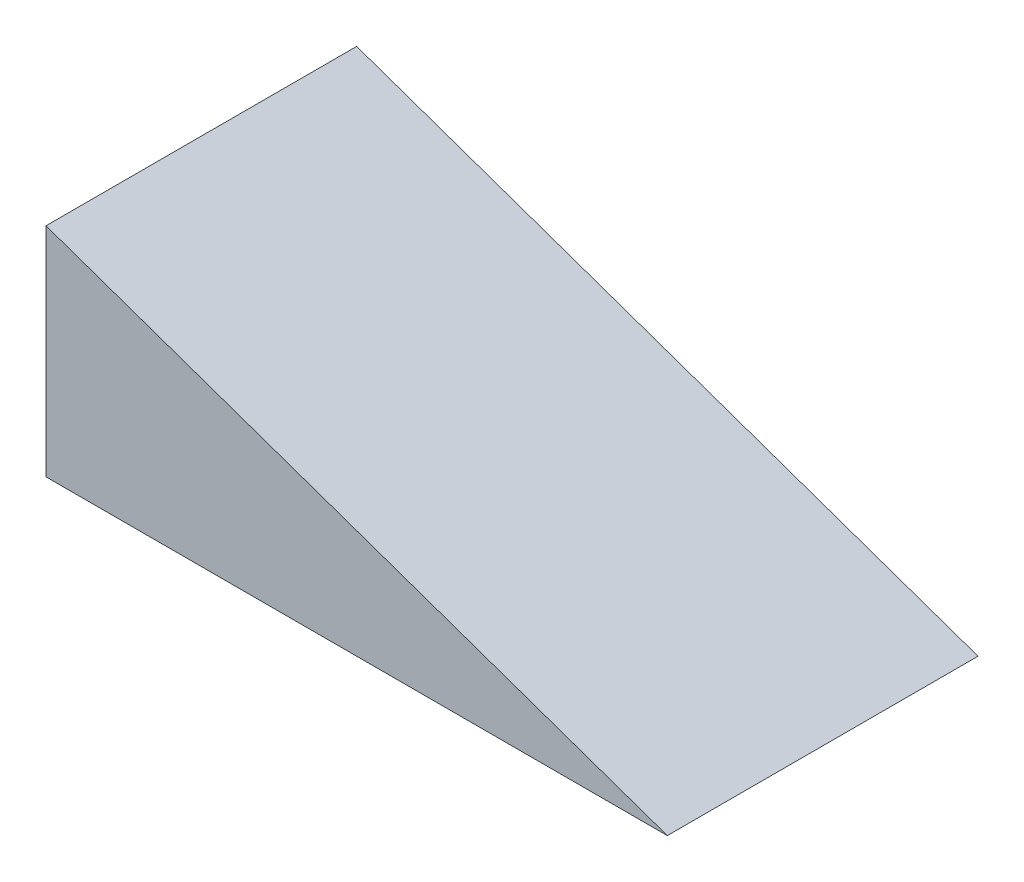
ISO-10303-21;
HEADER;
FILE_DESCRIPTION(('STEP AP214'),'2;1');
FILE_NAME('part.step','',(''),(''),'','','');
FILE_SCHEMA(('AUTOMOTIVE_DESIGN { 1 0 10303 214 1 1 1 1 }'));
ENDSEC;
DATA;
#1=APPLICATION_CONTEXT('core data for automotive mechanical design processes');
#2=APPLICATION_PROTOCOL_DEFINITION('international standard','automotive_design',2000,#1);
#3=PRODUCT_CONTEXT('',#1,'mechanical');
#4=PRODUCT('Part','Part','',(#3));
#5=PRODUCT_RELATED_PRODUCT_CATEGORY('part','',(#4));
#6=PRODUCT_DEFINITION_FORMATION('','',#4);
#7=PRODUCT_DEFINITION_CONTEXT('part definition',#1,'design');
#8=PRODUCT_DEFINITION('design','',#6,#7);
#9=PRODUCT_DEFINITION_SHAPE('','',#8);
#10=(LENGTH_UNIT() NAMED_UNIT(*) SI_UNIT(.MILLI.,.METRE.));
#11=(NAMED_UNIT(*) PLANE_ANGLE_UNIT() SI_UNIT($,.RADIAN.));
#12=(NAMED_UNIT(*) SI_UNIT($,.STERADIAN.) SOLID_ANGLE_UNIT());
#13=UNCERTAINTY_MEASURE_WITH_UNIT(LENGTH_MEASURE(1.E-05),#10,'distance_accuracy_value','');
#14=(GEOMETRIC_REPRESENTATION_CONTEXT(3) GLOBAL_UNCERTAINTY_ASSIGNED_CONTEXT((#13)) GLOBAL_UNIT_ASSIGNED_CONTEXT((#10,
#11,#12)) REPRESENTATION_CONTEXT('',''));
#15=CARTESIAN_POINT('',(0.,0.,0.));
#16=DIRECTION('',(0.,0.,1.));
#17=DIRECTION('',(1.,0.,0.));
#18=AXIS2_PLACEMENT_3D('',#15,#16,#17);
#19=CARTESIAN_POINT('',(0.,0.,100.));
#20=DIRECTION('',(1.,0.,0.));
#21=DIRECTION('',(0.,0.,-1.));
#22=AXIS2_PLACEMENT_3D('',#19,#20,#21);
#23=PLANE('',#22);
#24=DIRECTION('',(0.,-1.,0.));
#25=VECTOR('',#24,1.);
#26=CARTESIAN_POINT('',(0.,0.,0.));
#27=LINE('',#26,#25);
#28=CARTESIAN_POINT('',(0.,70.,0.));
#29=VERTEX_POINT('',#28);
#30=CARTESIAN_POINT('',(0.,0.,0.));
#31=VERTEX_POINT('',#30);
#32=EDGE_CURVE('E80',#29,#31,#27,.T.);
#33=ORIENTED_EDGE('',*,*,#32,.T.);
#34=DIRECTION('',(0.,0.,-1.));
#35=VECTOR('',#34,1.);
#36=CARTESIAN_POINT('',(0.,0.,100.));
#37=LINE('',#36,#35);
#38=CARTESIAN_POINT('',(0.,0.,100.));
#39=VERTEX_POINT('',#38);
#40=EDGE_CURVE('E11',#39,#31,#37,.T.);
#41=ORIENTED_EDGE('',*,*,#40,.F.);
#42=DIRECTION('',(0.,-1.,0.));
#43=VECTOR('',#42,1.);
#44=CARTESIAN_POINT('',(0.,0.,100.));
#45=LINE('',#44,#43);
#46=CARTESIAN_POINT('',(0.,70.,100.));
#47=VERTEX_POINT('',#46);
#48=EDGE_CURVE('E73',#47,#39,#45,.T.);
#49=ORIENTED_EDGE('',*,*,#48,.F.);
#50=DIRECTION('',(0.,0.,-1.));
#51=VECTOR('',#50,1.);
#52=CARTESIAN_POINT('',(0.,70.,100.));
#53=LINE('',#52,#51);
#54=EDGE_CURVE('E81',#47,#29,#53,.T.);
#55=ORIENTED_EDGE('',*,*,#54,.T.);
#56=EDGE_LOOP('',(#33,#41,#49,#55));
#57=FACE_BOUND('',#56,.T.);
#58=ADVANCED_FACE('F33',(#57),#23,.F.);
#59=CARTESIAN_POINT('',(0.,0.,100.));
#60=DIRECTION('',(0.,1.,0.));
#61=DIRECTION('',(0.,0.,1.));
#62=AXIS2_PLACEMENT_3D('',#59,#60,#61);
#63=PLANE('',#62);
#64=DIRECTION('',(1.,0.,0.));
#65=VECTOR('',#64,1.);
#66=CARTESIAN_POINT('',(0.,0.,0.));
#67=LINE('',#66,#65);
#68=CARTESIAN_POINT('',(200.,0.,0.));
#69=VERTEX_POINT('',#68);
#70=EDGE_CURVE('E61',#31,#69,#67,.T.);
#71=ORIENTED_EDGE('',*,*,#70,.T.);
#72=DIRECTION('',(0.,0.,-1.));
#73=VECTOR('',#72,1.);
#74=CARTESIAN_POINT('',(200.,0.,100.));
#75=LINE('',#74,#73);
#76=CARTESIAN_POINT('',(200.,0.,100.));
#77=VERTEX_POINT('',#76);
#78=EDGE_CURVE('E41',#77,#69,#75,.T.);
#79=ORIENTED_EDGE('',*,*,#78,.F.);
#80=DIRECTION('',(1.,0.,0.));
#81=VECTOR('',#80,1.);
#82=CARTESIAN_POINT('',(0.,0.,100.));
#83=LINE('',#82,#81);
#84=EDGE_CURVE('E69',#39,#77,#83,.T.);
#85=ORIENTED_EDGE('',*,*,#84,.F.);
#86=ORIENTED_EDGE('',*,*,#40,.T.);
#87=EDGE_LOOP('',(#71,#79,#85,#86));
#88=FACE_BOUND('',#87,.T.);
#89=ADVANCED_FACE('F70',(#88),#63,.F.);
#90=CARTESIAN_POINT('',(0.,70.,100.));
#91=DIRECTION('',(-0.330350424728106,-0.943858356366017,0.));
#92=DIRECTION('',(0.943858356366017,-0.330350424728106,0.));
#93=AXIS2_PLACEMENT_3D('',#90,#91,#92);
#94=PLANE('',#93);
#95=DIRECTION('',(-0.943858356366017,0.330350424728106,0.));
#96=VECTOR('',#95,1.);
#97=CARTESIAN_POINT('',(0.,70.,0.));
#98=LINE('',#97,#96);
#99=EDGE_CURVE('E66',#69,#29,#98,.T.);
#100=ORIENTED_EDGE('',*,*,#99,.T.);
#101=ORIENTED_EDGE('',*,*,#54,.F.);
#102=DIRECTION('',(-0.943858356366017,0.330350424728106,0.));
#103=VECTOR('',#102,1.);
#104=CARTESIAN_POINT('',(0.,70.,100.));
#105=LINE('',#104,#103);
#106=EDGE_CURVE('E49',#77,#47,#105,.T.);
#107=ORIENTED_EDGE('',*,*,#106,.F.);
#108=ORIENTED_EDGE('',*,*,#78,.T.);
#109=EDGE_LOOP('',(#100,#101,#107,#108));
#110=FACE_BOUND('',#109,.T.);
#111=ADVANCED_FACE('F88',(#110),#94,.F.);
#112=CARTESIAN_POINT('',(0.,0.,100.));
#113=DIRECTION('',(0.,0.,-1.));
#114=DIRECTION('',(-1.,0.,0.));
#115=AXIS2_PLACEMENT_3D('',#112,#113,#114);
#116=PLANE('',#115);
#117=ORIENTED_EDGE('',*,*,#48,.T.);
#118=ORIENTED_EDGE('',*,*,#84,.T.);
#119=ORIENTED_EDGE('',*,*,#106,.T.);
#120=EDGE_LOOP('',(#117,#118,#119));
#121=FACE_BOUND('',#120,.T.);
#122=ADVANCED_FACE('F76',(#121),#116,.F.);
#123=CARTESIAN_POINT('',(0.,0.,0.));
#124=DIRECTION('',(0.,0.,-1.));
#125=DIRECTION('',(-1.,0.,0.));
#126=AXIS2_PLACEMENT_3D('',#123,#124,#125);
#127=PLANE('',#126);
#128=ORIENTED_EDGE('',*,*,#32,.F.);
#129=ORIENTED_EDGE('',*,*,#99,.F.);
#130=ORIENTED_EDGE('',*,*,#70,.F.);
#131=EDGE_LOOP('',(#128,#129,#130));
#132=FACE_BOUND('',#131,.T.);
#133=ADVANCED_FACE('F89',(#132),#127,.T.);
#134=CLOSED_SHELL('',(#58,#89,#111,#122,#133));
#135=MANIFOLD_SOLID_BREP('B2',#134);
#136=ADVANCED_BREP_SHAPE_REPRESENTATION('',(#18,#135),#14);
#137=SHAPE_DEFINITION_REPRESENTATION(#9,#136);
ENDSEC;
END-ISO-10303-21;
